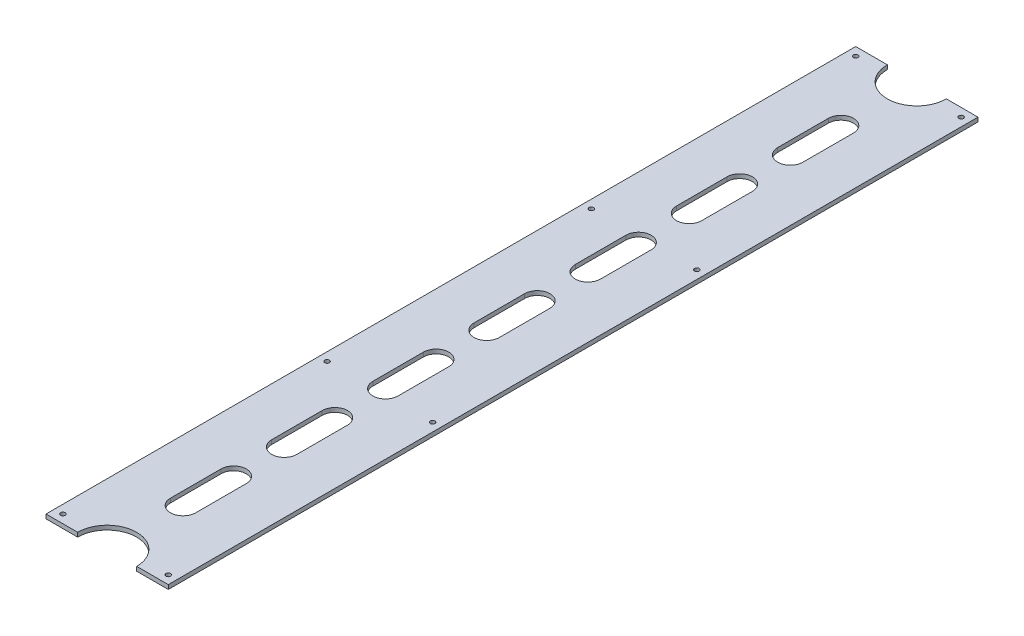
ISO-10303-21;
HEADER;
FILE_DESCRIPTION(('STEP AP214'),'2;1');
FILE_NAME('part.step','',(''),(''),'','','');
FILE_SCHEMA(('AUTOMOTIVE_DESIGN { 1 0 10303 214 1 1 1 1 }'));
ENDSEC;
DATA;
#1=APPLICATION_CONTEXT('core data for automotive mechanical design processes');
#2=APPLICATION_PROTOCOL_DEFINITION('international standard','automotive_design',2000,#1);
#3=PRODUCT_CONTEXT('',#1,'mechanical');
#4=PRODUCT('Part','Part','',(#3));
#5=PRODUCT_RELATED_PRODUCT_CATEGORY('part','',(#4));
#6=PRODUCT_DEFINITION_FORMATION('','',#4);
#7=PRODUCT_DEFINITION_CONTEXT('part definition',#1,'design');
#8=PRODUCT_DEFINITION('design','',#6,#7);
#9=PRODUCT_DEFINITION_SHAPE('','',#8);
#10=(LENGTH_UNIT() NAMED_UNIT(*) SI_UNIT(.MILLI.,.METRE.));
#11=(NAMED_UNIT(*) PLANE_ANGLE_UNIT() SI_UNIT($,.RADIAN.));
#12=(NAMED_UNIT(*) SI_UNIT($,.STERADIAN.) SOLID_ANGLE_UNIT());
#13=UNCERTAINTY_MEASURE_WITH_UNIT(LENGTH_MEASURE(1.E-05),#10,'distance_accuracy_value','');
#14=(GEOMETRIC_REPRESENTATION_CONTEXT(3) GLOBAL_UNCERTAINTY_ASSIGNED_CONTEXT((#13)) GLOBAL_UNIT_ASSIGNED_CONTEXT((#10,
#11,#12)) REPRESENTATION_CONTEXT('',''));
#15=CARTESIAN_POINT('',(0.,0.,0.));
#16=DIRECTION('',(0.,0.,1.));
#17=DIRECTION('',(1.,0.,0.));
#18=AXIS2_PLACEMENT_3D('',#15,#16,#17);
#19=CARTESIAN_POINT('',(-92.075,-6.35,609.6));
#20=DIRECTION('',(0.,0.,1.));
#21=DIRECTION('',(1.,0.,0.));
#22=AXIS2_PLACEMENT_3D('',#19,#20,#21);
#23=PLANE('',#22);
#24=DIRECTION('',(0.,1.,0.));
#25=VECTOR('',#24,1.);
#26=CARTESIAN_POINT('',(44.45,-6.35,609.6));
#27=LINE('',#26,#25);
#28=CARTESIAN_POINT('',(44.45,-6.35,609.6));
#29=VERTEX_POINT('',#28);
#30=CARTESIAN_POINT('',(44.45,0.,609.6));
#31=VERTEX_POINT('',#30);
#32=EDGE_CURVE('E355',#29,#31,#27,.T.);
#33=ORIENTED_EDGE('',*,*,#32,.F.);
#34=DIRECTION('',(1.,0.,0.));
#35=VECTOR('',#34,1.);
#36=CARTESIAN_POINT('',(-92.075,-6.35,609.6));
#37=LINE('',#36,#35);
#38=CARTESIAN_POINT('',(92.075,-6.35,609.6));
#39=VERTEX_POINT('',#38);
#40=EDGE_CURVE('E400',#29,#39,#37,.T.);
#41=ORIENTED_EDGE('',*,*,#40,.T.);
#42=DIRECTION('',(0.,1.,0.));
#43=VECTOR('',#42,1.);
#44=CARTESIAN_POINT('',(92.075,-6.35,609.6));
#45=LINE('',#44,#43);
#46=CARTESIAN_POINT('',(92.075,0.,609.6));
#47=VERTEX_POINT('',#46);
#48=EDGE_CURVE('E417',#39,#47,#45,.T.);
#49=ORIENTED_EDGE('',*,*,#48,.T.);
#50=DIRECTION('',(1.,0.,0.));
#51=VECTOR('',#50,1.);
#52=CARTESIAN_POINT('',(-92.075,0.,609.6));
#53=LINE('',#52,#51);
#54=EDGE_CURVE('E414',#31,#47,#53,.T.);
#55=ORIENTED_EDGE('',*,*,#54,.F.);
#56=EDGE_LOOP('',(#33,#41,#49,#55));
#57=FACE_BOUND('',#56,.T.);
#58=ADVANCED_FACE('F40',(#57),#23,.T.);
#59=CARTESIAN_POINT('',(-92.0750000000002,-6.35,-609.6));
#60=DIRECTION('',(0.,0.,-1.));
#61=DIRECTION('',(-1.,0.,0.));
#62=AXIS2_PLACEMENT_3D('',#59,#60,#61);
#63=PLANE('',#62);
#64=DIRECTION('',(0.,1.,0.));
#65=VECTOR('',#64,1.);
#66=CARTESIAN_POINT('',(-44.4500000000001,-6.35,-609.6));
#67=LINE('',#66,#65);
#68=CARTESIAN_POINT('',(-44.4500000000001,-6.35,-609.6));
#69=VERTEX_POINT('',#68);
#70=CARTESIAN_POINT('',(-44.4500000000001,0.,-609.6));
#71=VERTEX_POINT('',#70);
#72=EDGE_CURVE('E362',#69,#71,#67,.T.);
#73=ORIENTED_EDGE('',*,*,#72,.F.);
#74=DIRECTION('',(-1.,0.,0.));
#75=VECTOR('',#74,1.);
#76=CARTESIAN_POINT('',(-92.0750000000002,-6.35,-609.6));
#77=LINE('',#76,#75);
#78=CARTESIAN_POINT('',(-92.0750000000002,-6.35,-609.6));
#79=VERTEX_POINT('',#78);
#80=EDGE_CURVE('E392',#69,#79,#77,.T.);
#81=ORIENTED_EDGE('',*,*,#80,.T.);
#82=DIRECTION('',(0.,1.,0.));
#83=VECTOR('',#82,1.);
#84=CARTESIAN_POINT('',(-92.0750000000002,-6.35,-609.6));
#85=LINE('',#84,#83);
#86=CARTESIAN_POINT('',(-92.0750000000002,0.,-609.6));
#87=VERTEX_POINT('',#86);
#88=EDGE_CURVE('E423',#79,#87,#85,.T.);
#89=ORIENTED_EDGE('',*,*,#88,.T.);
#90=DIRECTION('',(-1.,0.,0.));
#91=VECTOR('',#90,1.);
#92=CARTESIAN_POINT('',(-92.0750000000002,0.,-609.6));
#93=LINE('',#92,#91);
#94=EDGE_CURVE('E407',#71,#87,#93,.T.);
#95=ORIENTED_EDGE('',*,*,#94,.F.);
#96=EDGE_LOOP('',(#73,#81,#89,#95));
#97=FACE_BOUND('',#96,.T.);
#98=ADVANCED_FACE('F622',(#97),#63,.T.);
#99=CARTESIAN_POINT('',(92.0749999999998,-6.35,-609.6));
#100=DIRECTION('',(1.,0.,0.));
#101=DIRECTION('',(0.,0.,-1.));
#102=AXIS2_PLACEMENT_3D('',#99,#100,#101);
#103=PLANE('',#102);
#104=DIRECTION('',(0.,0.,-1.));
#105=VECTOR('',#104,1.);
#106=CARTESIAN_POINT('',(92.0749999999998,0.,-609.6));
#107=LINE('',#106,#105);
#108=CARTESIAN_POINT('',(92.0749999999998,0.,-609.6));
#109=VERTEX_POINT('',#108);
#110=EDGE_CURVE('E386',#47,#109,#107,.T.);
#111=ORIENTED_EDGE('',*,*,#110,.F.);
#112=ORIENTED_EDGE('',*,*,#48,.F.);
#113=DIRECTION('',(0.,0.,-1.));
#114=VECTOR('',#113,1.);
#115=CARTESIAN_POINT('',(92.0749999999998,-6.35,-609.6));
#116=LINE('',#115,#114);
#117=CARTESIAN_POINT('',(92.0749999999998,-6.35,-609.6));
#118=VERTEX_POINT('',#117);
#119=EDGE_CURVE('E389',#39,#118,#116,.T.);
#120=ORIENTED_EDGE('',*,*,#119,.T.);
#121=DIRECTION('',(0.,1.,0.));
#122=VECTOR('',#121,1.);
#123=CARTESIAN_POINT('',(92.0749999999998,-6.35,-609.6));
#124=LINE('',#123,#122);
#125=EDGE_CURVE('E404',#118,#109,#124,.T.);
#126=ORIENTED_EDGE('',*,*,#125,.T.);
#127=EDGE_LOOP('',(#111,#112,#120,#126));
#128=FACE_BOUND('',#127,.T.);
#129=ADVANCED_FACE('F629',(#128),#103,.T.);
#130=DIRECTION('',(0.,1.,0.));
#131=VECTOR('',#130,1.);
#132=CARTESIAN_POINT('',(-44.45,-6.35,609.6));
#133=LINE('',#132,#131);
#134=CARTESIAN_POINT('',(-44.45,0.,609.6));
#135=VERTEX_POINT('',#134);
#136=CARTESIAN_POINT('',(-44.45,-6.35,609.6));
#137=VERTEX_POINT('',#136);
#138=EDGE_CURVE('E352',#135,#137,#133,.F.);
#139=ORIENTED_EDGE('',*,*,#138,.F.);
#140=CARTESIAN_POINT('',(-92.075,0.,609.6));
#141=VERTEX_POINT('',#140);
#142=EDGE_CURVE('E393',#141,#135,#53,.T.);
#143=ORIENTED_EDGE('',*,*,#142,.F.);
#144=DIRECTION('',(0.,1.,0.));
#145=VECTOR('',#144,1.);
#146=CARTESIAN_POINT('',(-92.075,-6.35,609.6));
#147=LINE('',#146,#145);
#148=CARTESIAN_POINT('',(-92.075,-6.35,609.6));
#149=VERTEX_POINT('',#148);
#150=EDGE_CURVE('E421',#149,#141,#147,.T.);
#151=ORIENTED_EDGE('',*,*,#150,.F.);
#152=EDGE_CURVE('E401',#149,#137,#37,.T.);
#153=ORIENTED_EDGE('',*,*,#152,.T.);
#154=EDGE_LOOP('',(#139,#143,#151,#153));
#155=FACE_BOUND('',#154,.T.);
#156=ADVANCED_FACE('F625',(#155),#23,.T.);
#157=CARTESIAN_POINT('',(-92.0750000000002,-6.35,-609.6));
#158=DIRECTION('',(-1.,0.,0.));
#159=DIRECTION('',(0.,0.,1.));
#160=AXIS2_PLACEMENT_3D('',#157,#158,#159);
#161=PLANE('',#160);
#162=DIRECTION('',(0.,0.,1.));
#163=VECTOR('',#162,1.);
#164=CARTESIAN_POINT('',(-92.0750000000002,0.,-609.6));
#165=LINE('',#164,#163);
#166=EDGE_CURVE('E411',#87,#141,#165,.T.);
#167=ORIENTED_EDGE('',*,*,#166,.F.);
#168=ORIENTED_EDGE('',*,*,#88,.F.);
#169=DIRECTION('',(0.,0.,1.));
#170=VECTOR('',#169,1.);
#171=CARTESIAN_POINT('',(-92.0750000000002,-6.35,-609.6));
#172=LINE('',#171,#170);
#173=EDGE_CURVE('E397',#79,#149,#172,.T.);
#174=ORIENTED_EDGE('',*,*,#173,.T.);
#175=ORIENTED_EDGE('',*,*,#150,.T.);
#176=EDGE_LOOP('',(#167,#168,#174,#175));
#177=FACE_BOUND('',#176,.T.);
#178=ADVANCED_FACE('F637',(#177),#161,.T.);
#179=DIRECTION('',(0.,1.,0.));
#180=VECTOR('',#179,1.);
#181=CARTESIAN_POINT('',(44.4499999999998,-6.35,-609.6));
#182=LINE('',#181,#180);
#183=CARTESIAN_POINT('',(44.4499999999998,0.,-609.6));
#184=VERTEX_POINT('',#183);
#185=CARTESIAN_POINT('',(44.4499999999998,-6.35,-609.6));
#186=VERTEX_POINT('',#185);
#187=EDGE_CURVE('E360',#184,#186,#182,.F.);
#188=ORIENTED_EDGE('',*,*,#187,.F.);
#189=EDGE_CURVE('E408',#109,#184,#93,.T.);
#190=ORIENTED_EDGE('',*,*,#189,.F.);
#191=ORIENTED_EDGE('',*,*,#125,.F.);
#192=EDGE_CURVE('E394',#118,#186,#77,.T.);
#193=ORIENTED_EDGE('',*,*,#192,.T.);
#194=EDGE_LOOP('',(#188,#190,#191,#193));
#195=FACE_BOUND('',#194,.T.);
#196=ADVANCED_FACE('F632',(#195),#63,.T.);
#197=CARTESIAN_POINT('',(0.,-6.35,0.));
#198=DIRECTION('',(0.,1.,0.));
#199=DIRECTION('',(0.,0.,1.));
#200=AXIS2_PLACEMENT_3D('',#197,#198,#199);
#201=PLANE('',#200);
#202=DIRECTION('',(0.,0.,-1.));
#203=VECTOR('',#202,1.);
#204=CARTESIAN_POINT('',(19.05,-6.35,-342.9));
#205=LINE('',#204,#203);
#206=CARTESIAN_POINT('',(19.05,-6.35,-266.7));
#207=VERTEX_POINT('',#206);
#208=CARTESIAN_POINT('',(19.05,-6.35,-342.9));
#209=VERTEX_POINT('',#208);
#210=EDGE_CURVE('E308',#207,#209,#205,.T.);
#211=ORIENTED_EDGE('',*,*,#210,.T.);
#212=CARTESIAN_POINT('',(0.,-6.35,-342.9));
#213=DIRECTION('',(0.,1.,0.));
#214=DIRECTION('',(0.,0.,1.));
#215=AXIS2_PLACEMENT_3D('',#212,#213,#214);
#216=CIRCLE('',#215,19.05);
#217=CARTESIAN_POINT('',(-19.05,-6.35,-342.9));
#218=VERTEX_POINT('',#217);
#219=EDGE_CURVE('E313',#209,#218,#216,.T.);
#220=ORIENTED_EDGE('',*,*,#219,.T.);
#221=DIRECTION('',(0.,0.,1.));
#222=VECTOR('',#221,1.);
#223=CARTESIAN_POINT('',(-19.05,-6.35,-342.9));
#224=LINE('',#223,#222);
#225=CARTESIAN_POINT('',(-19.05,-6.35,-266.7));
#226=VERTEX_POINT('',#225);
#227=EDGE_CURVE('E285',#218,#226,#224,.T.);
#228=ORIENTED_EDGE('',*,*,#227,.T.);
#229=CARTESIAN_POINT('',(0.,-6.35,-266.7));
#230=DIRECTION('',(0.,1.,0.));
#231=DIRECTION('',(0.,0.,1.));
#232=AXIS2_PLACEMENT_3D('',#229,#230,#231);
#233=CIRCLE('',#232,19.05);
#234=EDGE_CURVE('E292',#226,#207,#233,.T.);
#235=ORIENTED_EDGE('',*,*,#234,.T.);
#236=EDGE_LOOP('',(#211,#220,#228,#235));
#237=FACE_BOUND('',#236,.T.);
#238=DIRECTION('',(0.,0.,-1.));
#239=VECTOR('',#238,1.);
#240=CARTESIAN_POINT('',(19.05,-6.35,-495.3));
#241=LINE('',#240,#239);
#242=CARTESIAN_POINT('',(19.05,-6.35,-419.1));
#243=VERTEX_POINT('',#242);
#244=CARTESIAN_POINT('',(19.05,-6.35,-495.3));
#245=VERTEX_POINT('',#244);
#246=EDGE_CURVE('E327',#243,#245,#241,.T.);
#247=ORIENTED_EDGE('',*,*,#246,.T.);
#248=CARTESIAN_POINT('',(0.,-6.35,-495.3));
#249=DIRECTION('',(0.,1.,0.));
#250=DIRECTION('',(0.,0.,1.));
#251=AXIS2_PLACEMENT_3D('',#248,#249,#250);
#252=CIRCLE('',#251,19.05);
#253=CARTESIAN_POINT('',(-19.05,-6.35,-495.3));
#254=VERTEX_POINT('',#253);
#255=EDGE_CURVE('E317',#245,#254,#252,.T.);
#256=ORIENTED_EDGE('',*,*,#255,.T.);
#257=DIRECTION('',(0.,0.,1.));
#258=VECTOR('',#257,1.);
#259=CARTESIAN_POINT('',(-19.05,-6.35,-495.3));
#260=LINE('',#259,#258);
#261=CARTESIAN_POINT('',(-19.05,-6.35,-419.1));
#262=VERTEX_POINT('',#261);
#263=EDGE_CURVE('E320',#254,#262,#260,.T.);
#264=ORIENTED_EDGE('',*,*,#263,.T.);
#265=CARTESIAN_POINT('',(0.,-6.35,-419.1));
#266=DIRECTION('',(0.,1.,0.));
#267=DIRECTION('',(0.,0.,1.));
#268=AXIS2_PLACEMENT_3D('',#265,#266,#267);
#269=CIRCLE('',#268,19.05);
#270=EDGE_CURVE('E324',#262,#243,#269,.T.);
#271=ORIENTED_EDGE('',*,*,#270,.T.);
#272=EDGE_LOOP('',(#247,#256,#264,#271));
#273=FACE_BOUND('',#272,.T.);
#274=CARTESIAN_POINT('',(-79.3750000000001,-6.35,-198.96836));
#275=DIRECTION('',(0.,1.,0.));
#276=DIRECTION('',(0.,0.,1.));
#277=AXIS2_PLACEMENT_3D('',#274,#275,#276);
#278=CIRCLE('',#277,3.49249999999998);
#279=CARTESIAN_POINT('',(-79.3750000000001,-6.35,-195.47586));
#280=VERTEX_POINT('',#279);
#281=EDGE_CURVE('E364',#280,#280,#278,.T.);
#282=ORIENTED_EDGE('',*,*,#281,.T.);
#283=EDGE_LOOP('',(#282));
#284=FACE_BOUND('',#283,.T.);
#285=CARTESIAN_POINT('',(79.375,-6.35,-198.96836));
#286=DIRECTION('',(0.,1.,0.));
#287=DIRECTION('',(0.,0.,1.));
#288=AXIS2_PLACEMENT_3D('',#285,#286,#287);
#289=CIRCLE('',#288,3.49249999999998);
#290=CARTESIAN_POINT('',(79.375,-6.35,-195.47586));
#291=VERTEX_POINT('',#290);
#292=EDGE_CURVE('E370',#291,#291,#289,.T.);
#293=ORIENTED_EDGE('',*,*,#292,.T.);
#294=EDGE_LOOP('',(#293));
#295=FACE_BOUND('',#294,.T.);
#296=CARTESIAN_POINT('',(79.375,-6.35,-596.9));
#297=DIRECTION('',(0.,1.,0.));
#298=DIRECTION('',(0.,0.,1.));
#299=AXIS2_PLACEMENT_3D('',#296,#297,#298);
#300=CIRCLE('',#299,3.49249999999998);
#301=CARTESIAN_POINT('',(79.375,-6.35,-593.4075));
#302=VERTEX_POINT('',#301);
#303=EDGE_CURVE('E377',#302,#302,#300,.T.);
#304=ORIENTED_EDGE('',*,*,#303,.T.);
#305=EDGE_LOOP('',(#304));
#306=FACE_BOUND('',#305,.T.);
#307=CARTESIAN_POINT('',(-79.3750000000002,-6.35,-596.9));
#308=DIRECTION('',(0.,1.,0.));
#309=DIRECTION('',(0.,0.,1.));
#310=AXIS2_PLACEMENT_3D('',#307,#308,#309);
#311=CIRCLE('',#310,3.49249999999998);
#312=CARTESIAN_POINT('',(-79.3750000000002,-6.35,-593.4075));
#313=VERTEX_POINT('',#312);
#314=EDGE_CURVE('E383',#313,#313,#311,.T.);
#315=ORIENTED_EDGE('',*,*,#314,.T.);
#316=EDGE_LOOP('',(#315));
#317=FACE_BOUND('',#316,.T.);
#318=ORIENTED_EDGE('',*,*,#40,.F.);
#319=CARTESIAN_POINT('',(0.,-6.35,609.6));
#320=DIRECTION('',(0.,1.,0.));
#321=DIRECTION('',(0.,0.,1.));
#322=AXIS2_PLACEMENT_3D('',#319,#320,#321);
#323=CIRCLE('',#322,44.45);
#324=EDGE_CURVE('E349',#29,#137,#323,.T.);
#325=ORIENTED_EDGE('',*,*,#324,.T.);
#326=ORIENTED_EDGE('',*,*,#152,.F.);
#327=ORIENTED_EDGE('',*,*,#173,.F.);
#328=ORIENTED_EDGE('',*,*,#80,.F.);
#329=CARTESIAN_POINT('',(-1.52655665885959E-13,-6.35,-609.6));
#330=DIRECTION('',(0.,1.,0.));
#331=DIRECTION('',(0.,0.,1.));
#332=AXIS2_PLACEMENT_3D('',#329,#330,#331);
#333=CIRCLE('',#332,44.45);
#334=EDGE_CURVE('E357',#69,#186,#333,.T.);
#335=ORIENTED_EDGE('',*,*,#334,.T.);
#336=ORIENTED_EDGE('',*,*,#192,.F.);
#337=ORIENTED_EDGE('',*,*,#119,.F.);
#338=EDGE_LOOP('',(#318,#325,#326,#327,#328,#335,#336,#337));
#339=FACE_BOUND('',#338,.T.);
#340=CARTESIAN_POINT('',(79.3750000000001,-6.35,198.96328));
#341=DIRECTION('',(0.,1.,0.));
#342=DIRECTION('',(0.,0.,1.));
#343=AXIS2_PLACEMENT_3D('',#340,#341,#342);
#344=CIRCLE('',#343,3.49249999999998);
#345=CARTESIAN_POINT('',(79.3750000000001,-6.35,202.45578));
#346=VERTEX_POINT('',#345);
#347=EDGE_CURVE('E420',#346,#346,#344,.T.);
#348=ORIENTED_EDGE('',*,*,#347,.T.);
#349=EDGE_LOOP('',(#348));
#350=FACE_BOUND('',#349,.T.);
#351=CARTESIAN_POINT('',(79.3750000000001,-6.35,596.89492));
#352=DIRECTION('',(0.,1.,0.));
#353=DIRECTION('',(0.,0.,1.));
#354=AXIS2_PLACEMENT_3D('',#351,#352,#353);
#355=CIRCLE('',#354,3.49249999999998);
#356=CARTESIAN_POINT('',(79.3750000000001,-6.35,600.38742));
#357=VERTEX_POINT('',#356);
#358=EDGE_CURVE('E432',#357,#357,#355,.T.);
#359=ORIENTED_EDGE('',*,*,#358,.T.);
#360=EDGE_LOOP('',(#359));
#361=FACE_BOUND('',#360,.T.);
#362=CARTESIAN_POINT('',(-79.375,-6.35,198.96328));
#363=DIRECTION('',(0.,1.,0.));
#364=DIRECTION('',(0.,0.,1.));
#365=AXIS2_PLACEMENT_3D('',#362,#363,#364);
#366=CIRCLE('',#365,3.49249999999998);
#367=CARTESIAN_POINT('',(-79.375,-6.35,202.45578));
#368=VERTEX_POINT('',#367);
#369=EDGE_CURVE('E438',#368,#368,#366,.T.);
#370=ORIENTED_EDGE('',*,*,#369,.T.);
#371=EDGE_LOOP('',(#370));
#372=FACE_BOUND('',#371,.T.);
#373=CARTESIAN_POINT('',(-79.375,-6.35,596.89492));
#374=DIRECTION('',(0.,1.,0.));
#375=DIRECTION('',(0.,0.,1.));
#376=AXIS2_PLACEMENT_3D('',#373,#374,#375);
#377=CIRCLE('',#376,3.49249999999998);
#378=CARTESIAN_POINT('',(-79.375,-6.35,600.38742));
#379=VERTEX_POINT('',#378);
#380=EDGE_CURVE('E444',#379,#379,#377,.T.);
#381=ORIENTED_EDGE('',*,*,#380,.T.);
#382=EDGE_LOOP('',(#381));
#383=FACE_BOUND('',#382,.T.);
#384=CARTESIAN_POINT('',(0.,-6.35,-190.5));
#385=DIRECTION('',(0.,1.,0.));
#386=DIRECTION('',(0.,0.,1.));
#387=AXIS2_PLACEMENT_3D('',#384,#385,#386);
#388=CIRCLE('',#387,19.05);
#389=CARTESIAN_POINT('',(19.05,-6.35,-190.5));
#390=VERTEX_POINT('',#389);
#391=CARTESIAN_POINT('',(-19.05,-6.35,-190.5));
#392=VERTEX_POINT('',#391);
#393=EDGE_CURVE('E463',#390,#392,#388,.T.);
#394=ORIENTED_EDGE('',*,*,#393,.T.);
#395=DIRECTION('',(0.,0.,1.));
#396=VECTOR('',#395,1.);
#397=CARTESIAN_POINT('',(-19.05,-6.35,-190.5));
#398=LINE('',#397,#396);
#399=CARTESIAN_POINT('',(-19.0499999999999,-6.35,-114.3));
#400=VERTEX_POINT('',#399);
#401=EDGE_CURVE('E465',#392,#400,#398,.T.);
#402=ORIENTED_EDGE('',*,*,#401,.T.);
#403=CARTESIAN_POINT('',(0.,-6.35,-114.3));
#404=DIRECTION('',(0.,1.,0.));
#405=DIRECTION('',(0.,0.,1.));
#406=AXIS2_PLACEMENT_3D('',#403,#404,#405);
#407=CIRCLE('',#406,19.05);
#408=CARTESIAN_POINT('',(19.0500000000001,-6.35,-114.3));
#409=VERTEX_POINT('',#408);
#410=EDGE_CURVE('E467',#400,#409,#407,.T.);
#411=ORIENTED_EDGE('',*,*,#410,.T.);
#412=DIRECTION('',(0.,0.,-1.));
#413=VECTOR('',#412,1.);
#414=CARTESIAN_POINT('',(19.05,-6.35,-190.5));
#415=LINE('',#414,#413);
#416=EDGE_CURVE('E469',#409,#390,#415,.T.);
#417=ORIENTED_EDGE('',*,*,#416,.T.);
#418=EDGE_LOOP('',(#394,#402,#411,#417));
#419=FACE_BOUND('',#418,.T.);
#420=CARTESIAN_POINT('',(0.,-6.35,-38.0999999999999));
#421=DIRECTION('',(0.,1.,0.));
#422=DIRECTION('',(0.,0.,1.));
#423=AXIS2_PLACEMENT_3D('',#420,#421,#422);
#424=CIRCLE('',#423,19.05);
#425=CARTESIAN_POINT('',(19.0500000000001,-6.35,-38.0999999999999));
#426=VERTEX_POINT('',#425);
#427=CARTESIAN_POINT('',(-19.0499999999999,-6.35,-38.0999999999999));
#428=VERTEX_POINT('',#427);
#429=EDGE_CURVE('E495',#426,#428,#424,.T.);
#430=ORIENTED_EDGE('',*,*,#429,.T.);
#431=DIRECTION('',(0.,0.,1.));
#432=VECTOR('',#431,1.);
#433=CARTESIAN_POINT('',(-19.0499999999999,-6.35,-38.0999999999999));
#434=LINE('',#433,#432);
#435=CARTESIAN_POINT('',(-19.0499999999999,-6.35,38.1));
#436=VERTEX_POINT('',#435);
#437=EDGE_CURVE('E497',#428,#436,#434,.T.);
#438=ORIENTED_EDGE('',*,*,#437,.T.);
#439=CARTESIAN_POINT('',(0.,-6.35,38.1));
#440=DIRECTION('',(0.,1.,0.));
#441=DIRECTION('',(0.,0.,1.));
#442=AXIS2_PLACEMENT_3D('',#439,#440,#441);
#443=CIRCLE('',#442,19.05);
#444=CARTESIAN_POINT('',(19.0500000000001,-6.35,38.1));
#445=VERTEX_POINT('',#444);
#446=EDGE_CURVE('E499',#436,#445,#443,.T.);
#447=ORIENTED_EDGE('',*,*,#446,.T.);
#448=DIRECTION('',(0.,0.,-1.));
#449=VECTOR('',#448,1.);
#450=CARTESIAN_POINT('',(19.0500000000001,-6.35,-38.0999999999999));
#451=LINE('',#450,#449);
#452=EDGE_CURVE('E501',#445,#426,#451,.T.);
#453=ORIENTED_EDGE('',*,*,#452,.T.);
#454=EDGE_LOOP('',(#430,#438,#447,#453));
#455=FACE_BOUND('',#454,.T.);
#456=CARTESIAN_POINT('',(0.,-6.35,114.3));
#457=DIRECTION('',(0.,1.,0.));
#458=DIRECTION('',(0.,0.,1.));
#459=AXIS2_PLACEMENT_3D('',#456,#457,#458);
#460=CIRCLE('',#459,19.05);
#461=CARTESIAN_POINT('',(19.0500000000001,-6.35,114.3));
#462=VERTEX_POINT('',#461);
#463=CARTESIAN_POINT('',(-19.0499999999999,-6.35,114.3));
#464=VERTEX_POINT('',#463);
#465=EDGE_CURVE('E527',#462,#464,#460,.T.);
#466=ORIENTED_EDGE('',*,*,#465,.T.);
#467=DIRECTION('',(0.,0.,1.));
#468=VECTOR('',#467,1.);
#469=CARTESIAN_POINT('',(-19.0499999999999,-6.35,114.3));
#470=LINE('',#469,#468);
#471=CARTESIAN_POINT('',(-19.0499999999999,-6.35,190.5));
#472=VERTEX_POINT('',#471);
#473=EDGE_CURVE('E529',#464,#472,#470,.T.);
#474=ORIENTED_EDGE('',*,*,#473,.T.);
#475=CARTESIAN_POINT('',(0.,-6.35,190.5));
#476=DIRECTION('',(0.,1.,0.));
#477=DIRECTION('',(0.,0.,1.));
#478=AXIS2_PLACEMENT_3D('',#475,#476,#477);
#479=CIRCLE('',#478,19.05);
#480=CARTESIAN_POINT('',(19.0500000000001,-6.35,190.5));
#481=VERTEX_POINT('',#480);
#482=EDGE_CURVE('E531',#472,#481,#479,.T.);
#483=ORIENTED_EDGE('',*,*,#482,.T.);
#484=DIRECTION('',(0.,0.,-1.));
#485=VECTOR('',#484,1.);
#486=CARTESIAN_POINT('',(19.0500000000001,-6.35,114.3));
#487=LINE('',#486,#485);
#488=EDGE_CURVE('E533',#481,#462,#487,.T.);
#489=ORIENTED_EDGE('',*,*,#488,.T.);
#490=EDGE_LOOP('',(#466,#474,#483,#489));
#491=FACE_BOUND('',#490,.T.);
#492=CARTESIAN_POINT('',(0.,-6.35,266.7));
#493=DIRECTION('',(0.,1.,0.));
#494=DIRECTION('',(0.,0.,1.));
#495=AXIS2_PLACEMENT_3D('',#492,#493,#494);
#496=CIRCLE('',#495,19.05);
#497=CARTESIAN_POINT('',(19.0500000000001,-6.35,266.7));
#498=VERTEX_POINT('',#497);
#499=CARTESIAN_POINT('',(-19.0499999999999,-6.35,266.7));
#500=VERTEX_POINT('',#499);
#501=EDGE_CURVE('E559',#498,#500,#496,.T.);
#502=ORIENTED_EDGE('',*,*,#501,.T.);
#503=DIRECTION('',(0.,0.,1.));
#504=VECTOR('',#503,1.);
#505=CARTESIAN_POINT('',(-19.0499999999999,-6.35,266.7));
#506=LINE('',#505,#504);
#507=CARTESIAN_POINT('',(-19.0499999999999,-6.35,342.9));
#508=VERTEX_POINT('',#507);
#509=EDGE_CURVE('E561',#500,#508,#506,.T.);
#510=ORIENTED_EDGE('',*,*,#509,.T.);
#511=CARTESIAN_POINT('',(1.06296901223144E-13,-6.35,342.9));
#512=DIRECTION('',(0.,1.,0.));
#513=DIRECTION('',(0.,0.,1.));
#514=AXIS2_PLACEMENT_3D('',#511,#512,#513);
#515=CIRCLE('',#514,19.05);
#516=CARTESIAN_POINT('',(19.0500000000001,-6.35,342.9));
#517=VERTEX_POINT('',#516);
#518=EDGE_CURVE('E563',#508,#517,#515,.T.);
#519=ORIENTED_EDGE('',*,*,#518,.T.);
#520=DIRECTION('',(0.,0.,-1.));
#521=VECTOR('',#520,1.);
#522=CARTESIAN_POINT('',(19.0500000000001,-6.35,266.7));
#523=LINE('',#522,#521);
#524=EDGE_CURVE('E565',#517,#498,#523,.T.);
#525=ORIENTED_EDGE('',*,*,#524,.T.);
#526=EDGE_LOOP('',(#502,#510,#519,#525));
#527=FACE_BOUND('',#526,.T.);
#528=CARTESIAN_POINT('',(1.14491749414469E-13,-6.35,419.1));
#529=DIRECTION('',(0.,1.,0.));
#530=DIRECTION('',(0.,0.,1.));
#531=AXIS2_PLACEMENT_3D('',#528,#529,#530);
#532=CIRCLE('',#531,19.05);
#533=CARTESIAN_POINT('',(19.0500000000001,-6.35,419.1));
#534=VERTEX_POINT('',#533);
#535=CARTESIAN_POINT('',(-19.0499999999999,-6.35,419.1));
#536=VERTEX_POINT('',#535);
#537=EDGE_CURVE('E55',#534,#536,#532,.T.);
#538=ORIENTED_EDGE('',*,*,#537,.T.);
#539=DIRECTION('',(0.,0.,1.));
#540=VECTOR('',#539,1.);
#541=CARTESIAN_POINT('',(-19.0499999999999,-6.35,419.1));
#542=LINE('',#541,#540);
#543=CARTESIAN_POINT('',(-19.0499999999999,-6.35,495.3));
#544=VERTEX_POINT('',#543);
#545=EDGE_CURVE('E592',#536,#544,#542,.T.);
#546=ORIENTED_EDGE('',*,*,#545,.T.);
#547=CARTESIAN_POINT('',(1.25378859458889E-13,-6.35,495.3));
#548=DIRECTION('',(0.,1.,0.));
#549=DIRECTION('',(0.,0.,1.));
#550=AXIS2_PLACEMENT_3D('',#547,#548,#549);
#551=CIRCLE('',#550,19.05);
#552=CARTESIAN_POINT('',(19.0500000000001,-6.35,495.3));
#553=VERTEX_POINT('',#552);
#554=EDGE_CURVE('E62',#544,#553,#551,.T.);
#555=ORIENTED_EDGE('',*,*,#554,.T.);
#556=DIRECTION('',(0.,0.,-1.));
#557=VECTOR('',#556,1.);
#558=CARTESIAN_POINT('',(19.0500000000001,-6.35,419.1));
#559=LINE('',#558,#557);
#560=EDGE_CURVE('E595',#553,#534,#559,.T.);
#561=ORIENTED_EDGE('',*,*,#560,.T.);
#562=EDGE_LOOP('',(#538,#546,#555,#561));
#563=FACE_BOUND('',#562,.T.);
#564=ADVANCED_FACE('F662',(#237,#273,#284,#295,#306,#317,#339,#350,#361,#372,#383,#419,#455,
#491,#527,#563),#201,.F.);
#565=CARTESIAN_POINT('',(0.,0.,0.));
#566=DIRECTION('',(0.,1.,0.));
#567=DIRECTION('',(0.,0.,1.));
#568=AXIS2_PLACEMENT_3D('',#565,#566,#567);
#569=PLANE('',#568);
#570=CARTESIAN_POINT('',(0.,0.,-342.9));
#571=DIRECTION('',(0.,1.,0.));
#572=DIRECTION('',(0.,0.,1.));
#573=AXIS2_PLACEMENT_3D('',#570,#571,#572);
#574=CIRCLE('',#573,19.05);
#575=CARTESIAN_POINT('',(19.05,0.,-342.9));
#576=VERTEX_POINT('',#575);
#577=CARTESIAN_POINT('',(-19.05,0.,-342.9));
#578=VERTEX_POINT('',#577);
#579=EDGE_CURVE('E311',#576,#578,#574,.T.);
#580=ORIENTED_EDGE('',*,*,#579,.F.);
#581=DIRECTION('',(0.,0.,-1.));
#582=VECTOR('',#581,1.);
#583=CARTESIAN_POINT('',(19.05,0.,-342.9));
#584=LINE('',#583,#582);
#585=CARTESIAN_POINT('',(19.05,0.,-266.7));
#586=VERTEX_POINT('',#585);
#587=EDGE_CURVE('E297',#586,#576,#584,.T.);
#588=ORIENTED_EDGE('',*,*,#587,.F.);
#589=CARTESIAN_POINT('',(0.,0.,-266.7));
#590=DIRECTION('',(0.,1.,0.));
#591=DIRECTION('',(0.,0.,1.));
#592=AXIS2_PLACEMENT_3D('',#589,#590,#591);
#593=CIRCLE('',#592,19.05);
#594=CARTESIAN_POINT('',(-19.05,0.,-266.7));
#595=VERTEX_POINT('',#594);
#596=EDGE_CURVE('E289',#595,#586,#593,.T.);
#597=ORIENTED_EDGE('',*,*,#596,.F.);
#598=DIRECTION('',(0.,0.,1.));
#599=VECTOR('',#598,1.);
#600=CARTESIAN_POINT('',(-19.05,0.,-342.9));
#601=LINE('',#600,#599);
#602=EDGE_CURVE('E275',#578,#595,#601,.T.);
#603=ORIENTED_EDGE('',*,*,#602,.F.);
#604=EDGE_LOOP('',(#580,#588,#597,#603));
#605=FACE_BOUND('',#604,.T.);
#606=CARTESIAN_POINT('',(0.,0.,-495.3));
#607=DIRECTION('',(0.,1.,0.));
#608=DIRECTION('',(0.,0.,1.));
#609=AXIS2_PLACEMENT_3D('',#606,#607,#608);
#610=CIRCLE('',#609,19.05);
#611=CARTESIAN_POINT('',(19.05,0.,-495.3));
#612=VERTEX_POINT('',#611);
#613=CARTESIAN_POINT('',(-19.05,0.,-495.3));
#614=VERTEX_POINT('',#613);
#615=EDGE_CURVE('E316',#612,#614,#610,.T.);
#616=ORIENTED_EDGE('',*,*,#615,.F.);
#617=DIRECTION('',(0.,0.,-1.));
#618=VECTOR('',#617,1.);
#619=CARTESIAN_POINT('',(19.05,0.,-495.3));
#620=LINE('',#619,#618);
#621=CARTESIAN_POINT('',(19.05,0.,-419.1));
#622=VERTEX_POINT('',#621);
#623=EDGE_CURVE('E321',#622,#612,#620,.T.);
#624=ORIENTED_EDGE('',*,*,#623,.F.);
#625=CARTESIAN_POINT('',(0.,0.,-419.1));
#626=DIRECTION('',(0.,1.,0.));
#627=DIRECTION('',(0.,0.,1.));
#628=AXIS2_PLACEMENT_3D('',#625,#626,#627);
#629=CIRCLE('',#628,19.05);
#630=CARTESIAN_POINT('',(-19.05,0.,-419.1));
#631=VERTEX_POINT('',#630);
#632=EDGE_CURVE('E335',#631,#622,#629,.T.);
#633=ORIENTED_EDGE('',*,*,#632,.F.);
#634=DIRECTION('',(0.,0.,1.));
#635=VECTOR('',#634,1.);
#636=CARTESIAN_POINT('',(-19.05,0.,-495.3));
#637=LINE('',#636,#635);
#638=EDGE_CURVE('E332',#614,#631,#637,.T.);
#639=ORIENTED_EDGE('',*,*,#638,.F.);
#640=EDGE_LOOP('',(#616,#624,#633,#639));
#641=FACE_BOUND('',#640,.T.);
#642=CARTESIAN_POINT('',(0.,0.,609.6));
#643=DIRECTION('',(0.,1.,0.));
#644=DIRECTION('',(0.,0.,1.));
#645=AXIS2_PLACEMENT_3D('',#642,#643,#644);
#646=CIRCLE('',#645,44.45);
#647=EDGE_CURVE('E342',#31,#135,#646,.T.);
#648=ORIENTED_EDGE('',*,*,#647,.F.);
#649=ORIENTED_EDGE('',*,*,#54,.T.);
#650=ORIENTED_EDGE('',*,*,#110,.T.);
#651=ORIENTED_EDGE('',*,*,#189,.T.);
#652=CARTESIAN_POINT('',(-1.52655665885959E-13,0.,-609.6));
#653=DIRECTION('',(0.,1.,0.));
#654=DIRECTION('',(0.,0.,1.));
#655=AXIS2_PLACEMENT_3D('',#652,#653,#654);
#656=CIRCLE('',#655,44.45);
#657=EDGE_CURVE('E450',#71,#184,#656,.T.);
#658=ORIENTED_EDGE('',*,*,#657,.F.);
#659=ORIENTED_EDGE('',*,*,#94,.T.);
#660=ORIENTED_EDGE('',*,*,#166,.T.);
#661=ORIENTED_EDGE('',*,*,#142,.T.);
#662=EDGE_LOOP('',(#648,#649,#650,#651,#658,#659,#660,#661));
#663=FACE_BOUND('',#662,.T.);
#664=CARTESIAN_POINT('',(-79.3750000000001,0.,-198.96836));
#665=DIRECTION('',(0.,1.,0.));
#666=DIRECTION('',(0.,0.,1.));
#667=AXIS2_PLACEMENT_3D('',#664,#665,#666);
#668=CIRCLE('',#667,3.49249999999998);
#669=CARTESIAN_POINT('',(-79.3750000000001,0.,-195.47586));
#670=VERTEX_POINT('',#669);
#671=EDGE_CURVE('E367',#670,#670,#668,.T.);
#672=ORIENTED_EDGE('',*,*,#671,.F.);
#673=EDGE_LOOP('',(#672));
#674=FACE_BOUND('',#673,.T.);
#675=CARTESIAN_POINT('',(79.375,0.,-198.96836));
#676=DIRECTION('',(0.,1.,0.));
#677=DIRECTION('',(0.,0.,1.));
#678=AXIS2_PLACEMENT_3D('',#675,#676,#677);
#679=CIRCLE('',#678,3.49249999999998);
#680=CARTESIAN_POINT('',(79.375,0.,-195.47586));
#681=VERTEX_POINT('',#680);
#682=EDGE_CURVE('E373',#681,#681,#679,.T.);
#683=ORIENTED_EDGE('',*,*,#682,.F.);
#684=EDGE_LOOP('',(#683));
#685=FACE_BOUND('',#684,.T.);
#686=CARTESIAN_POINT('',(79.375,0.,-596.9));
#687=DIRECTION('',(0.,1.,0.));
#688=DIRECTION('',(0.,0.,1.));
#689=AXIS2_PLACEMENT_3D('',#686,#687,#688);
#690=CIRCLE('',#689,3.49249999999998);
#691=CARTESIAN_POINT('',(79.375,0.,-593.4075));
#692=VERTEX_POINT('',#691);
#693=EDGE_CURVE('E376',#692,#692,#690,.T.);
#694=ORIENTED_EDGE('',*,*,#693,.F.);
#695=EDGE_LOOP('',(#694));
#696=FACE_BOUND('',#695,.T.);
#697=CARTESIAN_POINT('',(-79.3750000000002,0.,-596.9));
#698=DIRECTION('',(0.,1.,0.));
#699=DIRECTION('',(0.,0.,1.));
#700=AXIS2_PLACEMENT_3D('',#697,#698,#699);
#701=CIRCLE('',#700,3.49249999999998);
#702=CARTESIAN_POINT('',(-79.3750000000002,0.,-593.4075));
#703=VERTEX_POINT('',#702);
#704=EDGE_CURVE('E380',#703,#703,#701,.T.);
#705=ORIENTED_EDGE('',*,*,#704,.F.);
#706=EDGE_LOOP('',(#705));
#707=FACE_BOUND('',#706,.T.);
#708=CARTESIAN_POINT('',(79.3750000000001,0.,198.96328));
#709=DIRECTION('',(0.,1.,0.));
#710=DIRECTION('',(0.,0.,1.));
#711=AXIS2_PLACEMENT_3D('',#708,#709,#710);
#712=CIRCLE('',#711,3.49249999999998);
#713=CARTESIAN_POINT('',(79.3750000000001,0.,202.45578));
#714=VERTEX_POINT('',#713);
#715=EDGE_CURVE('E429',#714,#714,#712,.T.);
#716=ORIENTED_EDGE('',*,*,#715,.F.);
#717=EDGE_LOOP('',(#716));
#718=FACE_BOUND('',#717,.T.);
#719=CARTESIAN_POINT('',(79.3750000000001,0.,596.89492));
#720=DIRECTION('',(0.,1.,0.));
#721=DIRECTION('',(0.,0.,1.));
#722=AXIS2_PLACEMENT_3D('',#719,#720,#721);
#723=CIRCLE('',#722,3.49249999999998);
#724=CARTESIAN_POINT('',(79.3750000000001,0.,600.38742));
#725=VERTEX_POINT('',#724);
#726=EDGE_CURVE('E435',#725,#725,#723,.T.);
#727=ORIENTED_EDGE('',*,*,#726,.F.);
#728=EDGE_LOOP('',(#727));
#729=FACE_BOUND('',#728,.T.);
#730=CARTESIAN_POINT('',(-79.375,0.,198.96328));
#731=DIRECTION('',(0.,1.,0.));
#732=DIRECTION('',(0.,0.,1.));
#733=AXIS2_PLACEMENT_3D('',#730,#731,#732);
#734=CIRCLE('',#733,3.49249999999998);
#735=CARTESIAN_POINT('',(-79.375,0.,202.45578));
#736=VERTEX_POINT('',#735);
#737=EDGE_CURVE('E441',#736,#736,#734,.T.);
#738=ORIENTED_EDGE('',*,*,#737,.F.);
#739=EDGE_LOOP('',(#738));
#740=FACE_BOUND('',#739,.T.);
#741=CARTESIAN_POINT('',(-79.375,0.,596.89492));
#742=DIRECTION('',(0.,1.,0.));
#743=DIRECTION('',(0.,0.,1.));
#744=AXIS2_PLACEMENT_3D('',#741,#742,#743);
#745=CIRCLE('',#744,3.49249999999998);
#746=CARTESIAN_POINT('',(-79.375,0.,600.38742));
#747=VERTEX_POINT('',#746);
#748=EDGE_CURVE('E447',#747,#747,#745,.T.);
#749=ORIENTED_EDGE('',*,*,#748,.F.);
#750=EDGE_LOOP('',(#749));
#751=FACE_BOUND('',#750,.T.);
#752=CARTESIAN_POINT('',(0.,0.,-190.5));
#753=DIRECTION('',(0.,1.,0.));
#754=DIRECTION('',(0.,0.,1.));
#755=AXIS2_PLACEMENT_3D('',#752,#753,#754);
#756=CIRCLE('',#755,19.05);
#757=CARTESIAN_POINT('',(19.05,0.,-190.5));
#758=VERTEX_POINT('',#757);
#759=CARTESIAN_POINT('',(-19.05,0.,-190.5));
#760=VERTEX_POINT('',#759);
#761=EDGE_CURVE('E452',#758,#760,#756,.T.);
#762=ORIENTED_EDGE('',*,*,#761,.F.);
#763=DIRECTION('',(0.,0.,-1.));
#764=VECTOR('',#763,1.);
#765=CARTESIAN_POINT('',(19.05,0.,-190.5));
#766=LINE('',#765,#764);
#767=CARTESIAN_POINT('',(19.0500000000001,0.,-114.3));
#768=VERTEX_POINT('',#767);
#769=EDGE_CURVE('E454',#768,#758,#766,.T.);
#770=ORIENTED_EDGE('',*,*,#769,.F.);
#771=CARTESIAN_POINT('',(0.,0.,-114.3));
#772=DIRECTION('',(0.,1.,0.));
#773=DIRECTION('',(0.,0.,1.));
#774=AXIS2_PLACEMENT_3D('',#771,#772,#773);
#775=CIRCLE('',#774,19.05);
#776=CARTESIAN_POINT('',(-19.0499999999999,0.,-114.3));
#777=VERTEX_POINT('',#776);
#778=EDGE_CURVE('E457',#777,#768,#775,.T.);
#779=ORIENTED_EDGE('',*,*,#778,.F.);
#780=DIRECTION('',(0.,0.,1.));
#781=VECTOR('',#780,1.);
#782=CARTESIAN_POINT('',(-19.05,0.,-190.5));
#783=LINE('',#782,#781);
#784=EDGE_CURVE('E460',#760,#777,#783,.T.);
#785=ORIENTED_EDGE('',*,*,#784,.F.);
#786=EDGE_LOOP('',(#762,#770,#779,#785));
#787=FACE_BOUND('',#786,.T.);
#788=CARTESIAN_POINT('',(0.,0.,-38.0999999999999));
#789=DIRECTION('',(0.,1.,0.));
#790=DIRECTION('',(0.,0.,1.));
#791=AXIS2_PLACEMENT_3D('',#788,#789,#790);
#792=CIRCLE('',#791,19.05);
#793=CARTESIAN_POINT('',(19.0500000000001,0.,-38.0999999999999));
#794=VERTEX_POINT('',#793);
#795=CARTESIAN_POINT('',(-19.0499999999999,0.,-38.0999999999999));
#796=VERTEX_POINT('',#795);
#797=EDGE_CURVE('E484',#794,#796,#792,.T.);
#798=ORIENTED_EDGE('',*,*,#797,.F.);
#799=DIRECTION('',(0.,0.,-1.));
#800=VECTOR('',#799,1.);
#801=CARTESIAN_POINT('',(19.0500000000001,0.,-38.0999999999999));
#802=LINE('',#801,#800);
#803=CARTESIAN_POINT('',(19.0500000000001,0.,38.1));
#804=VERTEX_POINT('',#803);
#805=EDGE_CURVE('E486',#804,#794,#802,.T.);
#806=ORIENTED_EDGE('',*,*,#805,.F.);
#807=CARTESIAN_POINT('',(0.,0.,38.1));
#808=DIRECTION('',(0.,1.,0.));
#809=DIRECTION('',(0.,0.,1.));
#810=AXIS2_PLACEMENT_3D('',#807,#808,#809);
#811=CIRCLE('',#810,19.05);
#812=CARTESIAN_POINT('',(-19.0499999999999,0.,38.1));
#813=VERTEX_POINT('',#812);
#814=EDGE_CURVE('E489',#813,#804,#811,.T.);
#815=ORIENTED_EDGE('',*,*,#814,.F.);
#816=DIRECTION('',(0.,0.,1.));
#817=VECTOR('',#816,1.);
#818=CARTESIAN_POINT('',(-19.0499999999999,0.,-38.0999999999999));
#819=LINE('',#818,#817);
#820=EDGE_CURVE('E492',#796,#813,#819,.T.);
#821=ORIENTED_EDGE('',*,*,#820,.F.);
#822=EDGE_LOOP('',(#798,#806,#815,#821));
#823=FACE_BOUND('',#822,.T.);
#824=CARTESIAN_POINT('',(0.,0.,114.3));
#825=DIRECTION('',(0.,1.,0.));
#826=DIRECTION('',(0.,0.,1.));
#827=AXIS2_PLACEMENT_3D('',#824,#825,#826);
#828=CIRCLE('',#827,19.05);
#829=CARTESIAN_POINT('',(19.0500000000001,0.,114.3));
#830=VERTEX_POINT('',#829);
#831=CARTESIAN_POINT('',(-19.0499999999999,0.,114.3));
#832=VERTEX_POINT('',#831);
#833=EDGE_CURVE('E516',#830,#832,#828,.T.);
#834=ORIENTED_EDGE('',*,*,#833,.F.);
#835=DIRECTION('',(0.,0.,-1.));
#836=VECTOR('',#835,1.);
#837=CARTESIAN_POINT('',(19.0500000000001,0.,114.3));
#838=LINE('',#837,#836);
#839=CARTESIAN_POINT('',(19.0500000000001,0.,190.5));
#840=VERTEX_POINT('',#839);
#841=EDGE_CURVE('E518',#840,#830,#838,.T.);
#842=ORIENTED_EDGE('',*,*,#841,.F.);
#843=CARTESIAN_POINT('',(0.,0.,190.5));
#844=DIRECTION('',(0.,1.,0.));
#845=DIRECTION('',(0.,0.,1.));
#846=AXIS2_PLACEMENT_3D('',#843,#844,#845);
#847=CIRCLE('',#846,19.05);
#848=CARTESIAN_POINT('',(-19.0499999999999,0.,190.5));
#849=VERTEX_POINT('',#848);
#850=EDGE_CURVE('E521',#849,#840,#847,.T.);
#851=ORIENTED_EDGE('',*,*,#850,.F.);
#852=DIRECTION('',(0.,0.,1.));
#853=VECTOR('',#852,1.);
#854=CARTESIAN_POINT('',(-19.0499999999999,0.,114.3));
#855=LINE('',#854,#853);
#856=EDGE_CURVE('E524',#832,#849,#855,.T.);
#857=ORIENTED_EDGE('',*,*,#856,.F.);
#858=EDGE_LOOP('',(#834,#842,#851,#857));
#859=FACE_BOUND('',#858,.T.);
#860=CARTESIAN_POINT('',(0.,0.,266.7));
#861=DIRECTION('',(0.,1.,0.));
#862=DIRECTION('',(0.,0.,1.));
#863=AXIS2_PLACEMENT_3D('',#860,#861,#862);
#864=CIRCLE('',#863,19.05);
#865=CARTESIAN_POINT('',(19.0500000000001,0.,266.7));
#866=VERTEX_POINT('',#865);
#867=CARTESIAN_POINT('',(-19.0499999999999,0.,266.7));
#868=VERTEX_POINT('',#867);
#869=EDGE_CURVE('E548',#866,#868,#864,.T.);
#870=ORIENTED_EDGE('',*,*,#869,.F.);
#871=DIRECTION('',(0.,0.,-1.));
#872=VECTOR('',#871,1.);
#873=CARTESIAN_POINT('',(19.0500000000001,0.,266.7));
#874=LINE('',#873,#872);
#875=CARTESIAN_POINT('',(19.0500000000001,0.,342.9));
#876=VERTEX_POINT('',#875);
#877=EDGE_CURVE('E550',#876,#866,#874,.T.);
#878=ORIENTED_EDGE('',*,*,#877,.F.);
#879=CARTESIAN_POINT('',(1.06296901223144E-13,0.,342.9));
#880=DIRECTION('',(0.,1.,0.));
#881=DIRECTION('',(0.,0.,1.));
#882=AXIS2_PLACEMENT_3D('',#879,#880,#881);
#883=CIRCLE('',#882,19.05);
#884=CARTESIAN_POINT('',(-19.0499999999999,0.,342.9));
#885=VERTEX_POINT('',#884);
#886=EDGE_CURVE('E553',#885,#876,#883,.T.);
#887=ORIENTED_EDGE('',*,*,#886,.F.);
#888=DIRECTION('',(0.,0.,1.));
#889=VECTOR('',#888,1.);
#890=CARTESIAN_POINT('',(-19.0499999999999,0.,266.7));
#891=LINE('',#890,#889);
#892=EDGE_CURVE('E556',#868,#885,#891,.T.);
#893=ORIENTED_EDGE('',*,*,#892,.F.);
#894=EDGE_LOOP('',(#870,#878,#887,#893));
#895=FACE_BOUND('',#894,.T.);
#896=CARTESIAN_POINT('',(1.14491749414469E-13,0.,419.1));
#897=DIRECTION('',(0.,1.,0.));
#898=DIRECTION('',(0.,0.,1.));
#899=AXIS2_PLACEMENT_3D('',#896,#897,#898);
#900=CIRCLE('',#899,19.05);
#901=CARTESIAN_POINT('',(19.0500000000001,0.,419.1));
#902=VERTEX_POINT('',#901);
#903=CARTESIAN_POINT('',(-19.0499999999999,0.,419.1));
#904=VERTEX_POINT('',#903);
#905=EDGE_CURVE('E580',#902,#904,#900,.T.);
#906=ORIENTED_EDGE('',*,*,#905,.F.);
#907=DIRECTION('',(0.,0.,-1.));
#908=VECTOR('',#907,1.);
#909=CARTESIAN_POINT('',(19.0500000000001,0.,419.1));
#910=LINE('',#909,#908);
#911=CARTESIAN_POINT('',(19.0500000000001,0.,495.3));
#912=VERTEX_POINT('',#911);
#913=EDGE_CURVE('E582',#912,#902,#910,.T.);
#914=ORIENTED_EDGE('',*,*,#913,.F.);
#915=CARTESIAN_POINT('',(1.25378859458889E-13,0.,495.3));
#916=DIRECTION('',(0.,1.,0.));
#917=DIRECTION('',(0.,0.,1.));
#918=AXIS2_PLACEMENT_3D('',#915,#916,#917);
#919=CIRCLE('',#918,19.05);
#920=CARTESIAN_POINT('',(-19.0499999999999,0.,495.3));
#921=VERTEX_POINT('',#920);
#922=EDGE_CURVE('E585',#921,#912,#919,.T.);
#923=ORIENTED_EDGE('',*,*,#922,.F.);
#924=DIRECTION('',(0.,0.,1.));
#925=VECTOR('',#924,1.);
#926=CARTESIAN_POINT('',(-19.0499999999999,0.,419.1));
#927=LINE('',#926,#925);
#928=EDGE_CURVE('E588',#904,#921,#927,.T.);
#929=ORIENTED_EDGE('',*,*,#928,.F.);
#930=EDGE_LOOP('',(#906,#914,#923,#929));
#931=FACE_BOUND('',#930,.T.);
#932=ADVANCED_FACE('F295',(#605,#641,#663,#674,#685,#696,#707,#718,#729,#740,#751,#787,#823,
#859,#895,#931),#569,.T.);
#933=CARTESIAN_POINT('',(-79.3750000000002,-6.35,-596.9));
#934=DIRECTION('',(0.,1.,0.));
#935=DIRECTION('',(0.,0.,1.));
#936=AXIS2_PLACEMENT_3D('',#933,#934,#935);
#937=CYLINDRICAL_SURFACE('',#936,3.49249999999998);
#938=ORIENTED_EDGE('',*,*,#314,.F.);
#939=EDGE_LOOP('',(#938));
#940=FACE_BOUND('',#939,.T.);
#941=ORIENTED_EDGE('',*,*,#704,.T.);
#942=EDGE_LOOP('',(#941));
#943=FACE_BOUND('',#942,.T.);
#944=ADVANCED_FACE('F702',(#940,#943),#937,.F.);
#945=CARTESIAN_POINT('',(79.375,-6.35,-596.9));
#946=DIRECTION('',(0.,1.,0.));
#947=DIRECTION('',(0.,0.,1.));
#948=AXIS2_PLACEMENT_3D('',#945,#946,#947);
#949=CYLINDRICAL_SURFACE('',#948,3.49249999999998);
#950=ORIENTED_EDGE('',*,*,#303,.F.);
#951=EDGE_LOOP('',(#950));
#952=FACE_BOUND('',#951,.T.);
#953=ORIENTED_EDGE('',*,*,#693,.T.);
#954=EDGE_LOOP('',(#953));
#955=FACE_BOUND('',#954,.T.);
#956=ADVANCED_FACE('F698',(#952,#955),#949,.F.);
#957=CARTESIAN_POINT('',(79.375,-6.35,-198.96836));
#958=DIRECTION('',(0.,1.,0.));
#959=DIRECTION('',(0.,0.,1.));
#960=AXIS2_PLACEMENT_3D('',#957,#958,#959);
#961=CYLINDRICAL_SURFACE('',#960,3.49249999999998);
#962=ORIENTED_EDGE('',*,*,#292,.F.);
#963=EDGE_LOOP('',(#962));
#964=FACE_BOUND('',#963,.T.);
#965=ORIENTED_EDGE('',*,*,#682,.T.);
#966=EDGE_LOOP('',(#965));
#967=FACE_BOUND('',#966,.T.);
#968=ADVANCED_FACE('F694',(#964,#967),#961,.F.);
#969=CARTESIAN_POINT('',(79.3750000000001,-6.35,198.96328));
#970=DIRECTION('',(0.,1.,0.));
#971=DIRECTION('',(0.,0.,1.));
#972=AXIS2_PLACEMENT_3D('',#969,#970,#971);
#973=CYLINDRICAL_SURFACE('',#972,3.49249999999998);
#974=ORIENTED_EDGE('',*,*,#347,.F.);
#975=EDGE_LOOP('',(#974));
#976=FACE_BOUND('',#975,.T.);
#977=ORIENTED_EDGE('',*,*,#715,.T.);
#978=EDGE_LOOP('',(#977));
#979=FACE_BOUND('',#978,.T.);
#980=ADVANCED_FACE('F697',(#976,#979),#973,.F.);
#981=CARTESIAN_POINT('',(79.3750000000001,-6.35,596.89492));
#982=DIRECTION('',(0.,1.,0.));
#983=DIRECTION('',(0.,0.,1.));
#984=AXIS2_PLACEMENT_3D('',#981,#982,#983);
#985=CYLINDRICAL_SURFACE('',#984,3.49249999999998);
#986=ORIENTED_EDGE('',*,*,#358,.F.);
#987=EDGE_LOOP('',(#986));
#988=FACE_BOUND('',#987,.T.);
#989=ORIENTED_EDGE('',*,*,#726,.T.);
#990=EDGE_LOOP('',(#989));
#991=FACE_BOUND('',#990,.T.);
#992=ADVANCED_FACE('F692',(#988,#991),#985,.F.);
#993=CARTESIAN_POINT('',(-79.3750000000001,-6.35,-198.96836));
#994=DIRECTION('',(0.,1.,0.));
#995=DIRECTION('',(0.,0.,1.));
#996=AXIS2_PLACEMENT_3D('',#993,#994,#995);
#997=CYLINDRICAL_SURFACE('',#996,3.49249999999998);
#998=ORIENTED_EDGE('',*,*,#281,.F.);
#999=EDGE_LOOP('',(#998));
#1000=FACE_BOUND('',#999,.T.);
#1001=ORIENTED_EDGE('',*,*,#671,.T.);
#1002=EDGE_LOOP('',(#1001));
#1003=FACE_BOUND('',#1002,.T.);
#1004=ADVANCED_FACE('F689',(#1000,#1003),#997,.F.);
#1005=CARTESIAN_POINT('',(-79.375,-6.35,198.96328));
#1006=DIRECTION('',(0.,1.,0.));
#1007=DIRECTION('',(0.,0.,1.));
#1008=AXIS2_PLACEMENT_3D('',#1005,#1006,#1007);
#1009=CYLINDRICAL_SURFACE('',#1008,3.49249999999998);
#1010=ORIENTED_EDGE('',*,*,#369,.F.);
#1011=EDGE_LOOP('',(#1010));
#1012=FACE_BOUND('',#1011,.T.);
#1013=ORIENTED_EDGE('',*,*,#737,.T.);
#1014=EDGE_LOOP('',(#1013));
#1015=FACE_BOUND('',#1014,.T.);
#1016=ADVANCED_FACE('F684',(#1012,#1015),#1009,.F.);
#1017=CARTESIAN_POINT('',(-79.375,-6.35,596.89492));
#1018=DIRECTION('',(0.,1.,0.));
#1019=DIRECTION('',(0.,0.,1.));
#1020=AXIS2_PLACEMENT_3D('',#1017,#1018,#1019);
#1021=CYLINDRICAL_SURFACE('',#1020,3.49249999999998);
#1022=ORIENTED_EDGE('',*,*,#380,.F.);
#1023=EDGE_LOOP('',(#1022));
#1024=FACE_BOUND('',#1023,.T.);
#1025=ORIENTED_EDGE('',*,*,#748,.T.);
#1026=EDGE_LOOP('',(#1025));
#1027=FACE_BOUND('',#1026,.T.);
#1028=ADVANCED_FACE('F676',(#1024,#1027),#1021,.F.);
#1029=CARTESIAN_POINT('',(-1.52655665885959E-13,-6.35,-609.6));
#1030=DIRECTION('',(0.,1.,0.));
#1031=DIRECTION('',(0.,0.,1.));
#1032=AXIS2_PLACEMENT_3D('',#1029,#1030,#1031);
#1033=CYLINDRICAL_SURFACE('',#1032,44.45);
#1034=ORIENTED_EDGE('',*,*,#72,.T.);
#1035=ORIENTED_EDGE('',*,*,#657,.T.);
#1036=ORIENTED_EDGE('',*,*,#187,.T.);
#1037=ORIENTED_EDGE('',*,*,#334,.F.);
#1038=EDGE_LOOP('',(#1034,#1035,#1036,#1037));
#1039=FACE_BOUND('',#1038,.T.);
#1040=ADVANCED_FACE('F673',(#1039),#1033,.F.);
#1041=CARTESIAN_POINT('',(0.,-6.35,609.6));
#1042=DIRECTION('',(0.,1.,0.));
#1043=DIRECTION('',(0.,0.,1.));
#1044=AXIS2_PLACEMENT_3D('',#1041,#1042,#1043);
#1045=CYLINDRICAL_SURFACE('',#1044,44.45);
#1046=ORIENTED_EDGE('',*,*,#32,.T.);
#1047=ORIENTED_EDGE('',*,*,#647,.T.);
#1048=ORIENTED_EDGE('',*,*,#138,.T.);
#1049=ORIENTED_EDGE('',*,*,#324,.F.);
#1050=EDGE_LOOP('',(#1046,#1047,#1048,#1049));
#1051=FACE_BOUND('',#1050,.T.);
#1052=ADVANCED_FACE('F665',(#1051),#1045,.F.);
#1053=CARTESIAN_POINT('',(0.,-6.35,-495.3));
#1054=DIRECTION('',(0.,1.,0.));
#1055=DIRECTION('',(0.,0.,1.));
#1056=AXIS2_PLACEMENT_3D('',#1053,#1054,#1055);
#1057=CYLINDRICAL_SURFACE('',#1056,19.05);
#1058=ORIENTED_EDGE('',*,*,#615,.T.);
#1059=DIRECTION('',(0.,1.,0.));
#1060=VECTOR('',#1059,1.);
#1061=CARTESIAN_POINT('',(-19.05,-6.35,-495.3));
#1062=LINE('',#1061,#1060);
#1063=EDGE_CURVE('E330',#254,#614,#1062,.T.);
#1064=ORIENTED_EDGE('',*,*,#1063,.F.);
#1065=ORIENTED_EDGE('',*,*,#255,.F.);
#1066=DIRECTION('',(0.,1.,0.));
#1067=VECTOR('',#1066,1.);
#1068=CARTESIAN_POINT('',(19.05,-6.35,-495.3));
#1069=LINE('',#1068,#1067);
#1070=EDGE_CURVE('E340',#245,#612,#1069,.T.);
#1071=ORIENTED_EDGE('',*,*,#1070,.T.);
#1072=EDGE_LOOP('',(#1058,#1064,#1065,#1071));
#1073=FACE_BOUND('',#1072,.T.);
#1074=ADVANCED_FACE('F682',(#1073),#1057,.F.);
#1075=CARTESIAN_POINT('',(19.05,-6.35,-495.3));
#1076=DIRECTION('',(1.,0.,0.));
#1077=DIRECTION('',(0.,0.,-1.));
#1078=AXIS2_PLACEMENT_3D('',#1075,#1076,#1077);
#1079=PLANE('',#1078);
#1080=ORIENTED_EDGE('',*,*,#623,.T.);
#1081=ORIENTED_EDGE('',*,*,#1070,.F.);
#1082=ORIENTED_EDGE('',*,*,#246,.F.);
#1083=DIRECTION('',(0.,1.,0.));
#1084=VECTOR('',#1083,1.);
#1085=CARTESIAN_POINT('',(19.05,-6.35,-419.1));
#1086=LINE('',#1085,#1084);
#1087=EDGE_CURVE('E343',#243,#622,#1086,.T.);
#1088=ORIENTED_EDGE('',*,*,#1087,.T.);
#1089=EDGE_LOOP('',(#1080,#1081,#1082,#1088));
#1090=FACE_BOUND('',#1089,.T.);
#1091=ADVANCED_FACE('F805',(#1090),#1079,.F.);
#1092=CARTESIAN_POINT('',(0.,-6.35,-419.1));
#1093=DIRECTION('',(0.,1.,0.));
#1094=DIRECTION('',(0.,0.,1.));
#1095=AXIS2_PLACEMENT_3D('',#1092,#1093,#1094);
#1096=CYLINDRICAL_SURFACE('',#1095,19.05);
#1097=ORIENTED_EDGE('',*,*,#632,.T.);
#1098=ORIENTED_EDGE('',*,*,#1087,.F.);
#1099=ORIENTED_EDGE('',*,*,#270,.F.);
#1100=DIRECTION('',(0.,1.,0.));
#1101=VECTOR('',#1100,1.);
#1102=CARTESIAN_POINT('',(-19.05,-6.35,-419.1));
#1103=LINE('',#1102,#1101);
#1104=EDGE_CURVE('E345',#262,#631,#1103,.T.);
#1105=ORIENTED_EDGE('',*,*,#1104,.T.);
#1106=EDGE_LOOP('',(#1097,#1098,#1099,#1105));
#1107=FACE_BOUND('',#1106,.T.);
#1108=ADVANCED_FACE('F815',(#1107),#1096,.F.);
#1109=CARTESIAN_POINT('',(-19.05,-6.35,-495.3));
#1110=DIRECTION('',(-1.,0.,0.));
#1111=DIRECTION('',(0.,0.,1.));
#1112=AXIS2_PLACEMENT_3D('',#1109,#1110,#1111);
#1113=PLANE('',#1112);
#1114=ORIENTED_EDGE('',*,*,#638,.T.);
#1115=ORIENTED_EDGE('',*,*,#1104,.F.);
#1116=ORIENTED_EDGE('',*,*,#263,.F.);
#1117=ORIENTED_EDGE('',*,*,#1063,.T.);
#1118=EDGE_LOOP('',(#1114,#1115,#1116,#1117));
#1119=FACE_BOUND('',#1118,.T.);
#1120=ADVANCED_FACE('F826',(#1119),#1113,.F.);
#1121=CARTESIAN_POINT('',(0.,-6.35,-342.9));
#1122=DIRECTION('',(0.,1.,0.));
#1123=DIRECTION('',(0.,0.,1.));
#1124=AXIS2_PLACEMENT_3D('',#1121,#1122,#1123);
#1125=CYLINDRICAL_SURFACE('',#1124,19.05);
#1126=ORIENTED_EDGE('',*,*,#579,.T.);
#1127=DIRECTION('',(0.,1.,0.));
#1128=VECTOR('',#1127,1.);
#1129=CARTESIAN_POINT('',(-19.05,-6.35,-342.9));
#1130=LINE('',#1129,#1128);
#1131=EDGE_CURVE('E281',#218,#578,#1130,.T.);
#1132=ORIENTED_EDGE('',*,*,#1131,.F.);
#1133=ORIENTED_EDGE('',*,*,#219,.F.);
#1134=DIRECTION('',(0.,1.,0.));
#1135=VECTOR('',#1134,1.);
#1136=CARTESIAN_POINT('',(19.05,-6.35,-342.9));
#1137=LINE('',#1136,#1135);
#1138=EDGE_CURVE('E305',#209,#576,#1137,.T.);
#1139=ORIENTED_EDGE('',*,*,#1138,.T.);
#1140=EDGE_LOOP('',(#1126,#1132,#1133,#1139));
#1141=FACE_BOUND('',#1140,.T.);
#1142=ADVANCED_FACE('F836',(#1141),#1125,.F.);
#1143=CARTESIAN_POINT('',(19.05,-6.35,-342.9));
#1144=DIRECTION('',(1.,0.,0.));
#1145=DIRECTION('',(0.,0.,-1.));
#1146=AXIS2_PLACEMENT_3D('',#1143,#1144,#1145);
#1147=PLANE('',#1146);
#1148=ORIENTED_EDGE('',*,*,#587,.T.);
#1149=ORIENTED_EDGE('',*,*,#1138,.F.);
#1150=ORIENTED_EDGE('',*,*,#210,.F.);
#1151=DIRECTION('',(0.,1.,0.));
#1152=VECTOR('',#1151,1.);
#1153=CARTESIAN_POINT('',(19.05,-6.35,-266.7));
#1154=LINE('',#1153,#1152);
#1155=EDGE_CURVE('E298',#207,#586,#1154,.T.);
#1156=ORIENTED_EDGE('',*,*,#1155,.T.);
#1157=EDGE_LOOP('',(#1148,#1149,#1150,#1156));
#1158=FACE_BOUND('',#1157,.T.);
#1159=ADVANCED_FACE('F900',(#1158),#1147,.F.);
#1160=CARTESIAN_POINT('',(0.,-6.35,-266.7));
#1161=DIRECTION('',(0.,1.,0.));
#1162=DIRECTION('',(0.,0.,1.));
#1163=AXIS2_PLACEMENT_3D('',#1160,#1161,#1162);
#1164=CYLINDRICAL_SURFACE('',#1163,19.05);
#1165=ORIENTED_EDGE('',*,*,#596,.T.);
#1166=ORIENTED_EDGE('',*,*,#1155,.F.);
#1167=ORIENTED_EDGE('',*,*,#234,.F.);
#1168=DIRECTION('',(0.,1.,0.));
#1169=VECTOR('',#1168,1.);
#1170=CARTESIAN_POINT('',(-19.05,-6.35,-266.7));
#1171=LINE('',#1170,#1169);
#1172=EDGE_CURVE('E278',#226,#595,#1171,.T.);
#1173=ORIENTED_EDGE('',*,*,#1172,.T.);
#1174=EDGE_LOOP('',(#1165,#1166,#1167,#1173));
#1175=FACE_BOUND('',#1174,.T.);
#1176=ADVANCED_FACE('F288',(#1175),#1164,.F.);
#1177=CARTESIAN_POINT('',(-19.05,-6.35,-342.9));
#1178=DIRECTION('',(-1.,0.,0.));
#1179=DIRECTION('',(0.,0.,1.));
#1180=AXIS2_PLACEMENT_3D('',#1177,#1178,#1179);
#1181=PLANE('',#1180);
#1182=ORIENTED_EDGE('',*,*,#602,.T.);
#1183=ORIENTED_EDGE('',*,*,#1172,.F.);
#1184=ORIENTED_EDGE('',*,*,#227,.F.);
#1185=ORIENTED_EDGE('',*,*,#1131,.T.);
#1186=EDGE_LOOP('',(#1182,#1183,#1184,#1185));
#1187=FACE_BOUND('',#1186,.T.);
#1188=ADVANCED_FACE('F277',(#1187),#1181,.F.);
#1189=CARTESIAN_POINT('',(-19.05,-6.35,-190.5));
#1190=DIRECTION('',(-1.,0.,0.));
#1191=DIRECTION('',(0.,0.,1.));
#1192=AXIS2_PLACEMENT_3D('',#1189,#1190,#1191);
#1193=PLANE('',#1192);
#1194=ORIENTED_EDGE('',*,*,#784,.T.);
#1195=DIRECTION('',(0.,1.,0.));
#1196=VECTOR('',#1195,1.);
#1197=CARTESIAN_POINT('',(-19.0499999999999,-6.35,-114.3));
#1198=LINE('',#1197,#1196);
#1199=EDGE_CURVE('E481',#400,#777,#1198,.T.);
#1200=ORIENTED_EDGE('',*,*,#1199,.F.);
#1201=ORIENTED_EDGE('',*,*,#401,.F.);
#1202=DIRECTION('',(0.,1.,0.));
#1203=VECTOR('',#1202,1.);
#1204=CARTESIAN_POINT('',(-19.05,-6.35,-190.5));
#1205=LINE('',#1204,#1203);
#1206=EDGE_CURVE('E472',#392,#760,#1205,.T.);
#1207=ORIENTED_EDGE('',*,*,#1206,.T.);
#1208=EDGE_LOOP('',(#1194,#1200,#1201,#1207));
#1209=FACE_BOUND('',#1208,.T.);
#1210=ADVANCED_FACE('F920',(#1209),#1193,.F.);
#1211=CARTESIAN_POINT('',(0.,-6.35,-114.3));
#1212=DIRECTION('',(0.,1.,0.));
#1213=DIRECTION('',(0.,0.,1.));
#1214=AXIS2_PLACEMENT_3D('',#1211,#1212,#1213);
#1215=CYLINDRICAL_SURFACE('',#1214,19.05);
#1216=ORIENTED_EDGE('',*,*,#778,.T.);
#1217=DIRECTION('',(0.,1.,0.));
#1218=VECTOR('',#1217,1.);
#1219=CARTESIAN_POINT('',(19.0500000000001,-6.35,-114.3));
#1220=LINE('',#1219,#1218);
#1221=EDGE_CURVE('E478',#409,#768,#1220,.T.);
#1222=ORIENTED_EDGE('',*,*,#1221,.F.);
#1223=ORIENTED_EDGE('',*,*,#410,.F.);
#1224=ORIENTED_EDGE('',*,*,#1199,.T.);
#1225=EDGE_LOOP('',(#1216,#1222,#1223,#1224));
#1226=FACE_BOUND('',#1225,.T.);
#1227=ADVANCED_FACE('F927',(#1226),#1215,.F.);
#1228=CARTESIAN_POINT('',(19.05,-6.35,-190.5));
#1229=DIRECTION('',(1.,0.,0.));
#1230=DIRECTION('',(0.,0.,-1.));
#1231=AXIS2_PLACEMENT_3D('',#1228,#1229,#1230);
#1232=PLANE('',#1231);
#1233=ORIENTED_EDGE('',*,*,#769,.T.);
#1234=DIRECTION('',(0.,1.,0.));
#1235=VECTOR('',#1234,1.);
#1236=CARTESIAN_POINT('',(19.05,-6.35,-190.5));
#1237=LINE('',#1236,#1235);
#1238=EDGE_CURVE('E475',#390,#758,#1237,.T.);
#1239=ORIENTED_EDGE('',*,*,#1238,.F.);
#1240=ORIENTED_EDGE('',*,*,#416,.F.);
#1241=ORIENTED_EDGE('',*,*,#1221,.T.);
#1242=EDGE_LOOP('',(#1233,#1239,#1240,#1241));
#1243=FACE_BOUND('',#1242,.T.);
#1244=ADVANCED_FACE('F935',(#1243),#1232,.F.);
#1245=CARTESIAN_POINT('',(0.,-6.35,-190.5));
#1246=DIRECTION('',(0.,1.,0.));
#1247=DIRECTION('',(0.,0.,1.));
#1248=AXIS2_PLACEMENT_3D('',#1245,#1246,#1247);
#1249=CYLINDRICAL_SURFACE('',#1248,19.05);
#1250=ORIENTED_EDGE('',*,*,#761,.T.);
#1251=ORIENTED_EDGE('',*,*,#1206,.F.);
#1252=ORIENTED_EDGE('',*,*,#393,.F.);
#1253=ORIENTED_EDGE('',*,*,#1238,.T.);
#1254=EDGE_LOOP('',(#1250,#1251,#1252,#1253));
#1255=FACE_BOUND('',#1254,.T.);
#1256=ADVANCED_FACE('F943',(#1255),#1249,.F.);
#1257=CARTESIAN_POINT('',(-19.0499999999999,-6.35,-38.0999999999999));
#1258=DIRECTION('',(-1.,0.,0.));
#1259=DIRECTION('',(0.,0.,1.));
#1260=AXIS2_PLACEMENT_3D('',#1257,#1258,#1259);
#1261=PLANE('',#1260);
#1262=ORIENTED_EDGE('',*,*,#820,.T.);
#1263=DIRECTION('',(0.,1.,0.));
#1264=VECTOR('',#1263,1.);
#1265=CARTESIAN_POINT('',(-19.0499999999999,-6.35,38.1));
#1266=LINE('',#1265,#1264);
#1267=EDGE_CURVE('E513',#436,#813,#1266,.T.);
#1268=ORIENTED_EDGE('',*,*,#1267,.F.);
#1269=ORIENTED_EDGE('',*,*,#437,.F.);
#1270=DIRECTION('',(0.,1.,0.));
#1271=VECTOR('',#1270,1.);
#1272=CARTESIAN_POINT('',(-19.0499999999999,-6.35,-38.0999999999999));
#1273=LINE('',#1272,#1271);
#1274=EDGE_CURVE('E504',#428,#796,#1273,.T.);
#1275=ORIENTED_EDGE('',*,*,#1274,.T.);
#1276=EDGE_LOOP('',(#1262,#1268,#1269,#1275));
#1277=FACE_BOUND('',#1276,.T.);
#1278=ADVANCED_FACE('F951',(#1277),#1261,.F.);
#1279=CARTESIAN_POINT('',(0.,-6.35,38.1));
#1280=DIRECTION('',(0.,1.,0.));
#1281=DIRECTION('',(0.,0.,1.));
#1282=AXIS2_PLACEMENT_3D('',#1279,#1280,#1281);
#1283=CYLINDRICAL_SURFACE('',#1282,19.05);
#1284=ORIENTED_EDGE('',*,*,#814,.T.);
#1285=DIRECTION('',(0.,1.,0.));
#1286=VECTOR('',#1285,1.);
#1287=CARTESIAN_POINT('',(19.0500000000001,-6.35,38.1));
#1288=LINE('',#1287,#1286);
#1289=EDGE_CURVE('E510',#445,#804,#1288,.T.);
#1290=ORIENTED_EDGE('',*,*,#1289,.F.);
#1291=ORIENTED_EDGE('',*,*,#446,.F.);
#1292=ORIENTED_EDGE('',*,*,#1267,.T.);
#1293=EDGE_LOOP('',(#1284,#1290,#1291,#1292));
#1294=FACE_BOUND('',#1293,.T.);
#1295=ADVANCED_FACE('F959',(#1294),#1283,.F.);
#1296=CARTESIAN_POINT('',(19.0500000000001,-6.35,-38.0999999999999));
#1297=DIRECTION('',(1.,0.,0.));
#1298=DIRECTION('',(0.,0.,-1.));
#1299=AXIS2_PLACEMENT_3D('',#1296,#1297,#1298);
#1300=PLANE('',#1299);
#1301=ORIENTED_EDGE('',*,*,#805,.T.);
#1302=DIRECTION('',(0.,1.,0.));
#1303=VECTOR('',#1302,1.);
#1304=CARTESIAN_POINT('',(19.0500000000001,-6.35,-38.0999999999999));
#1305=LINE('',#1304,#1303);
#1306=EDGE_CURVE('E507',#426,#794,#1305,.T.);
#1307=ORIENTED_EDGE('',*,*,#1306,.F.);
#1308=ORIENTED_EDGE('',*,*,#452,.F.);
#1309=ORIENTED_EDGE('',*,*,#1289,.T.);
#1310=EDGE_LOOP('',(#1301,#1307,#1308,#1309));
#1311=FACE_BOUND('',#1310,.T.);
#1312=ADVANCED_FACE('F967',(#1311),#1300,.F.);
#1313=CARTESIAN_POINT('',(0.,-6.35,-38.0999999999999));
#1314=DIRECTION('',(0.,1.,0.));
#1315=DIRECTION('',(0.,0.,1.));
#1316=AXIS2_PLACEMENT_3D('',#1313,#1314,#1315);
#1317=CYLINDRICAL_SURFACE('',#1316,19.05);
#1318=ORIENTED_EDGE('',*,*,#797,.T.);
#1319=ORIENTED_EDGE('',*,*,#1274,.F.);
#1320=ORIENTED_EDGE('',*,*,#429,.F.);
#1321=ORIENTED_EDGE('',*,*,#1306,.T.);
#1322=EDGE_LOOP('',(#1318,#1319,#1320,#1321));
#1323=FACE_BOUND('',#1322,.T.);
#1324=ADVANCED_FACE('F975',(#1323),#1317,.F.);
#1325=CARTESIAN_POINT('',(-19.0499999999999,-6.35,114.3));
#1326=DIRECTION('',(-1.,0.,0.));
#1327=DIRECTION('',(0.,0.,1.));
#1328=AXIS2_PLACEMENT_3D('',#1325,#1326,#1327);
#1329=PLANE('',#1328);
#1330=ORIENTED_EDGE('',*,*,#856,.T.);
#1331=DIRECTION('',(0.,1.,0.));
#1332=VECTOR('',#1331,1.);
#1333=CARTESIAN_POINT('',(-19.0499999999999,-6.35,190.5));
#1334=LINE('',#1333,#1332);
#1335=EDGE_CURVE('E545',#472,#849,#1334,.T.);
#1336=ORIENTED_EDGE('',*,*,#1335,.F.);
#1337=ORIENTED_EDGE('',*,*,#473,.F.);
#1338=DIRECTION('',(0.,1.,0.));
#1339=VECTOR('',#1338,1.);
#1340=CARTESIAN_POINT('',(-19.0499999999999,-6.35,114.3));
#1341=LINE('',#1340,#1339);
#1342=EDGE_CURVE('E536',#464,#832,#1341,.T.);
#1343=ORIENTED_EDGE('',*,*,#1342,.T.);
#1344=EDGE_LOOP('',(#1330,#1336,#1337,#1343));
#1345=FACE_BOUND('',#1344,.T.);
#1346=ADVANCED_FACE('F983',(#1345),#1329,.F.);
#1347=CARTESIAN_POINT('',(0.,-6.35,190.5));
#1348=DIRECTION('',(0.,1.,0.));
#1349=DIRECTION('',(0.,0.,1.));
#1350=AXIS2_PLACEMENT_3D('',#1347,#1348,#1349);
#1351=CYLINDRICAL_SURFACE('',#1350,19.05);
#1352=ORIENTED_EDGE('',*,*,#850,.T.);
#1353=DIRECTION('',(0.,1.,0.));
#1354=VECTOR('',#1353,1.);
#1355=CARTESIAN_POINT('',(19.0500000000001,-6.35,190.5));
#1356=LINE('',#1355,#1354);
#1357=EDGE_CURVE('E542',#481,#840,#1356,.T.);
#1358=ORIENTED_EDGE('',*,*,#1357,.F.);
#1359=ORIENTED_EDGE('',*,*,#482,.F.);
#1360=ORIENTED_EDGE('',*,*,#1335,.T.);
#1361=EDGE_LOOP('',(#1352,#1358,#1359,#1360));
#1362=FACE_BOUND('',#1361,.T.);
#1363=ADVANCED_FACE('F991',(#1362),#1351,.F.);
#1364=CARTESIAN_POINT('',(19.0500000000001,-6.35,114.3));
#1365=DIRECTION('',(1.,0.,0.));
#1366=DIRECTION('',(0.,0.,-1.));
#1367=AXIS2_PLACEMENT_3D('',#1364,#1365,#1366);
#1368=PLANE('',#1367);
#1369=ORIENTED_EDGE('',*,*,#841,.T.);
#1370=DIRECTION('',(0.,1.,0.));
#1371=VECTOR('',#1370,1.);
#1372=CARTESIAN_POINT('',(19.0500000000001,-6.35,114.3));
#1373=LINE('',#1372,#1371);
#1374=EDGE_CURVE('E539',#462,#830,#1373,.T.);
#1375=ORIENTED_EDGE('',*,*,#1374,.F.);
#1376=ORIENTED_EDGE('',*,*,#488,.F.);
#1377=ORIENTED_EDGE('',*,*,#1357,.T.);
#1378=EDGE_LOOP('',(#1369,#1375,#1376,#1377));
#1379=FACE_BOUND('',#1378,.T.);
#1380=ADVANCED_FACE('F999',(#1379),#1368,.F.);
#1381=CARTESIAN_POINT('',(0.,-6.35,114.3));
#1382=DIRECTION('',(0.,1.,0.));
#1383=DIRECTION('',(0.,0.,1.));
#1384=AXIS2_PLACEMENT_3D('',#1381,#1382,#1383);
#1385=CYLINDRICAL_SURFACE('',#1384,19.05);
#1386=ORIENTED_EDGE('',*,*,#833,.T.);
#1387=ORIENTED_EDGE('',*,*,#1342,.F.);
#1388=ORIENTED_EDGE('',*,*,#465,.F.);
#1389=ORIENTED_EDGE('',*,*,#1374,.T.);
#1390=EDGE_LOOP('',(#1386,#1387,#1388,#1389));
#1391=FACE_BOUND('',#1390,.T.);
#1392=ADVANCED_FACE('F1007',(#1391),#1385,.F.);
#1393=CARTESIAN_POINT('',(-19.0499999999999,-6.35,266.7));
#1394=DIRECTION('',(-1.,0.,0.));
#1395=DIRECTION('',(0.,0.,1.));
#1396=AXIS2_PLACEMENT_3D('',#1393,#1394,#1395);
#1397=PLANE('',#1396);
#1398=ORIENTED_EDGE('',*,*,#892,.T.);
#1399=DIRECTION('',(0.,1.,0.));
#1400=VECTOR('',#1399,1.);
#1401=CARTESIAN_POINT('',(-19.0499999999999,-6.35,342.9));
#1402=LINE('',#1401,#1400);
#1403=EDGE_CURVE('E577',#508,#885,#1402,.T.);
#1404=ORIENTED_EDGE('',*,*,#1403,.F.);
#1405=ORIENTED_EDGE('',*,*,#509,.F.);
#1406=DIRECTION('',(0.,1.,0.));
#1407=VECTOR('',#1406,1.);
#1408=CARTESIAN_POINT('',(-19.0499999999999,-6.35,266.7));
#1409=LINE('',#1408,#1407);
#1410=EDGE_CURVE('E568',#500,#868,#1409,.T.);
#1411=ORIENTED_EDGE('',*,*,#1410,.T.);
#1412=EDGE_LOOP('',(#1398,#1404,#1405,#1411));
#1413=FACE_BOUND('',#1412,.T.);
#1414=ADVANCED_FACE('F1015',(#1413),#1397,.F.);
#1415=CARTESIAN_POINT('',(1.06296901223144E-13,-6.35,342.9));
#1416=DIRECTION('',(0.,1.,0.));
#1417=DIRECTION('',(0.,0.,1.));
#1418=AXIS2_PLACEMENT_3D('',#1415,#1416,#1417);
#1419=CYLINDRICAL_SURFACE('',#1418,19.05);
#1420=ORIENTED_EDGE('',*,*,#886,.T.);
#1421=DIRECTION('',(0.,1.,0.));
#1422=VECTOR('',#1421,1.);
#1423=CARTESIAN_POINT('',(19.0500000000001,-6.35,342.9));
#1424=LINE('',#1423,#1422);
#1425=EDGE_CURVE('E574',#517,#876,#1424,.T.);
#1426=ORIENTED_EDGE('',*,*,#1425,.F.);
#1427=ORIENTED_EDGE('',*,*,#518,.F.);
#1428=ORIENTED_EDGE('',*,*,#1403,.T.);
#1429=EDGE_LOOP('',(#1420,#1426,#1427,#1428));
#1430=FACE_BOUND('',#1429,.T.);
#1431=ADVANCED_FACE('F1023',(#1430),#1419,.F.);
#1432=CARTESIAN_POINT('',(19.0500000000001,-6.35,266.7));
#1433=DIRECTION('',(1.,0.,0.));
#1434=DIRECTION('',(0.,0.,-1.));
#1435=AXIS2_PLACEMENT_3D('',#1432,#1433,#1434);
#1436=PLANE('',#1435);
#1437=ORIENTED_EDGE('',*,*,#877,.T.);
#1438=DIRECTION('',(0.,1.,0.));
#1439=VECTOR('',#1438,1.);
#1440=CARTESIAN_POINT('',(19.0500000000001,-6.35,266.7));
#1441=LINE('',#1440,#1439);
#1442=EDGE_CURVE('E571',#498,#866,#1441,.T.);
#1443=ORIENTED_EDGE('',*,*,#1442,.F.);
#1444=ORIENTED_EDGE('',*,*,#524,.F.);
#1445=ORIENTED_EDGE('',*,*,#1425,.T.);
#1446=EDGE_LOOP('',(#1437,#1443,#1444,#1445));
#1447=FACE_BOUND('',#1446,.T.);
#1448=ADVANCED_FACE('F1030',(#1447),#1436,.F.);
#1449=CARTESIAN_POINT('',(0.,-6.35,266.7));
#1450=DIRECTION('',(0.,1.,0.));
#1451=DIRECTION('',(0.,0.,1.));
#1452=AXIS2_PLACEMENT_3D('',#1449,#1450,#1451);
#1453=CYLINDRICAL_SURFACE('',#1452,19.05);
#1454=ORIENTED_EDGE('',*,*,#869,.T.);
#1455=ORIENTED_EDGE('',*,*,#1410,.F.);
#1456=ORIENTED_EDGE('',*,*,#501,.F.);
#1457=ORIENTED_EDGE('',*,*,#1442,.T.);
#1458=EDGE_LOOP('',(#1454,#1455,#1456,#1457));
#1459=FACE_BOUND('',#1458,.T.);
#1460=ADVANCED_FACE('F1038',(#1459),#1453,.F.);
#1461=CARTESIAN_POINT('',(-19.0499999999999,-6.35,419.1));
#1462=DIRECTION('',(-1.,0.,0.));
#1463=DIRECTION('',(0.,0.,1.));
#1464=AXIS2_PLACEMENT_3D('',#1461,#1462,#1463);
#1465=PLANE('',#1464);
#1466=ORIENTED_EDGE('',*,*,#928,.T.);
#1467=DIRECTION('',(0.,1.,0.));
#1468=VECTOR('',#1467,1.);
#1469=CARTESIAN_POINT('',(-19.0499999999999,-6.35,495.3));
#1470=LINE('',#1469,#1468);
#1471=EDGE_CURVE('E11',#544,#921,#1470,.T.);
#1472=ORIENTED_EDGE('',*,*,#1471,.F.);
#1473=ORIENTED_EDGE('',*,*,#545,.F.);
#1474=DIRECTION('',(0.,1.,0.));
#1475=VECTOR('',#1474,1.);
#1476=CARTESIAN_POINT('',(-19.0499999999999,-6.35,419.1));
#1477=LINE('',#1476,#1475);
#1478=EDGE_CURVE('E597',#536,#904,#1477,.T.);
#1479=ORIENTED_EDGE('',*,*,#1478,.T.);
#1480=EDGE_LOOP('',(#1466,#1472,#1473,#1479));
#1481=FACE_BOUND('',#1480,.T.);
#1482=ADVANCED_FACE('F42',(#1481),#1465,.F.);
#1483=CARTESIAN_POINT('',(1.25378859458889E-13,-6.35,495.3));
#1484=DIRECTION('',(0.,1.,0.));
#1485=DIRECTION('',(0.,0.,1.));
#1486=AXIS2_PLACEMENT_3D('',#1483,#1484,#1485);
#1487=CYLINDRICAL_SURFACE('',#1486,19.05);
#1488=ORIENTED_EDGE('',*,*,#922,.T.);
#1489=DIRECTION('',(0.,1.,0.));
#1490=VECTOR('',#1489,1.);
#1491=CARTESIAN_POINT('',(19.0500000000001,-6.35,495.3));
#1492=LINE('',#1491,#1490);
#1493=EDGE_CURVE('E48',#553,#912,#1492,.T.);
#1494=ORIENTED_EDGE('',*,*,#1493,.F.);
#1495=ORIENTED_EDGE('',*,*,#554,.F.);
#1496=ORIENTED_EDGE('',*,*,#1471,.T.);
#1497=EDGE_LOOP('',(#1488,#1494,#1495,#1496));
#1498=FACE_BOUND('',#1497,.T.);
#1499=ADVANCED_FACE('F607',(#1498),#1487,.F.);
#1500=CARTESIAN_POINT('',(19.0500000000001,-6.35,419.1));
#1501=DIRECTION('',(1.,0.,0.));
#1502=DIRECTION('',(0.,0.,-1.));
#1503=AXIS2_PLACEMENT_3D('',#1500,#1501,#1502);
#1504=PLANE('',#1503);
#1505=ORIENTED_EDGE('',*,*,#913,.T.);
#1506=DIRECTION('',(0.,1.,0.));
#1507=VECTOR('',#1506,1.);
#1508=CARTESIAN_POINT('',(19.0500000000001,-6.35,419.1));
#1509=LINE('',#1508,#1507);
#1510=EDGE_CURVE('E600',#534,#902,#1509,.T.);
#1511=ORIENTED_EDGE('',*,*,#1510,.F.);
#1512=ORIENTED_EDGE('',*,*,#560,.F.);
#1513=ORIENTED_EDGE('',*,*,#1493,.T.);
#1514=EDGE_LOOP('',(#1505,#1511,#1512,#1513));
#1515=FACE_BOUND('',#1514,.T.);
#1516=ADVANCED_FACE('F604',(#1515),#1504,.F.);
#1517=CARTESIAN_POINT('',(1.14491749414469E-13,-6.35,419.1));
#1518=DIRECTION('',(0.,1.,0.));
#1519=DIRECTION('',(0.,0.,1.));
#1520=AXIS2_PLACEMENT_3D('',#1517,#1518,#1519);
#1521=CYLINDRICAL_SURFACE('',#1520,19.05);
#1522=ORIENTED_EDGE('',*,*,#905,.T.);
#1523=ORIENTED_EDGE('',*,*,#1478,.F.);
#1524=ORIENTED_EDGE('',*,*,#537,.F.);
#1525=ORIENTED_EDGE('',*,*,#1510,.T.);
#1526=EDGE_LOOP('',(#1522,#1523,#1524,#1525));
#1527=FACE_BOUND('',#1526,.T.);
#1528=ADVANCED_FACE('F613',(#1527),#1521,.F.);
#1529=CLOSED_SHELL('',(#58,#98,#129,#156,#178,#196,#564,#932,#944,#956,#968,#980,#992,#1004,
#1016,#1028,#1040,#1052,#1074,#1091,#1108,#1120,#1142,#1159,#1176,#1188,#1210,#1227,#1244,#1256,
#1278,#1295,#1312,#1324,#1346,#1363,#1380,#1392,#1414,#1431,#1448,#1460,#1482,#1499,#1516,#1528));
#1530=MANIFOLD_SOLID_BREP('B2',#1529);
#1531=ADVANCED_BREP_SHAPE_REPRESENTATION('',(#18,#1530),#14);
#1532=SHAPE_DEFINITION_REPRESENTATION(#9,#1531);
ENDSEC;
END-ISO-10303-21;
